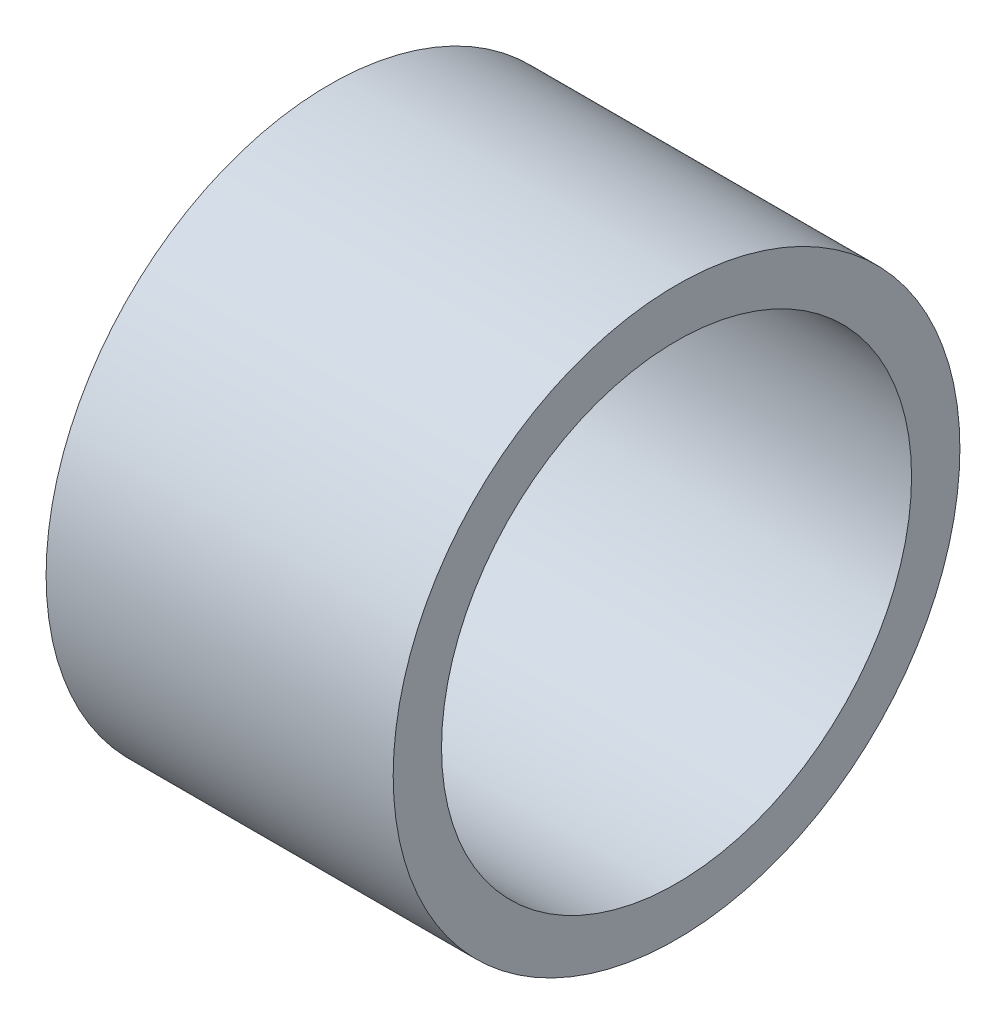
from build123d import *

# Parameters (mm, degrees)
ESQUISSE1_W = 24
ESQUISSE1_H = 3.343564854


with BuildPart() as part:
    # Esquisse1 → R_volution1 (revolve)
    with BuildSketch(Plane.XY, mode=Mode.PRIVATE) as r_volution1_sk:
        with Locations((94.977861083, -152.902195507)):
            Rectangle(ESQUISSE1_W, ESQUISSE1_H)
    revolve(r_volution1_sk.sketch.rotate(Axis((54.689735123, -170.823977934, 0), (1, 0, 0)), 90), axis=Axis((54.689735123, -170.823977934, 0), (1, 0, 0)))


solid = part.part
